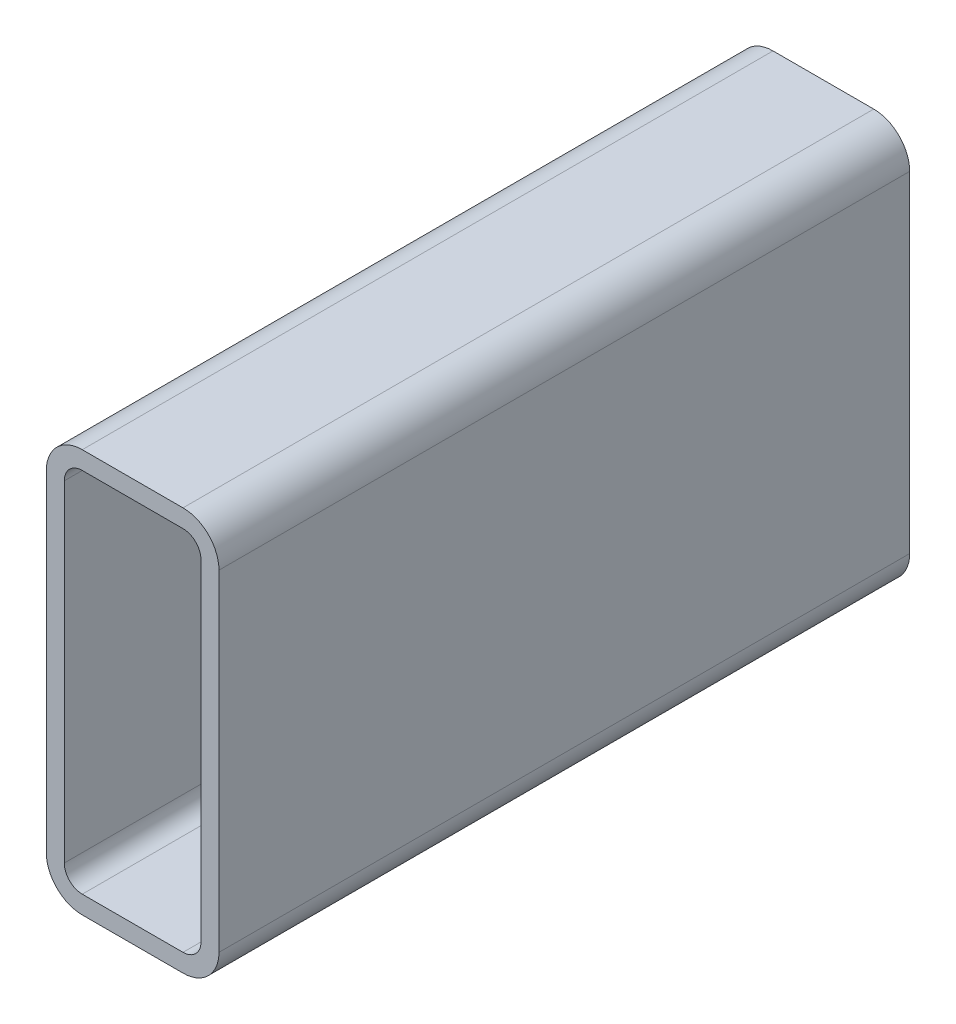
ISO-10303-21;
HEADER;
FILE_DESCRIPTION(('STEP AP214'),'2;1');
FILE_NAME('part.step','',(''),(''),'','','');
FILE_SCHEMA(('AUTOMOTIVE_DESIGN { 1 0 10303 214 1 1 1 1 }'));
ENDSEC;
DATA;
#1=APPLICATION_CONTEXT('core data for automotive mechanical design processes');
#2=APPLICATION_PROTOCOL_DEFINITION('international standard','automotive_design',2000,#1);
#3=PRODUCT_CONTEXT('',#1,'mechanical');
#4=PRODUCT('Part','Part','',(#3));
#5=PRODUCT_RELATED_PRODUCT_CATEGORY('part','',(#4));
#6=PRODUCT_DEFINITION_FORMATION('','',#4);
#7=PRODUCT_DEFINITION_CONTEXT('part definition',#1,'design');
#8=PRODUCT_DEFINITION('design','',#6,#7);
#9=PRODUCT_DEFINITION_SHAPE('','',#8);
#10=(LENGTH_UNIT() NAMED_UNIT(*) SI_UNIT(.MILLI.,.METRE.));
#11=(NAMED_UNIT(*) PLANE_ANGLE_UNIT() SI_UNIT($,.RADIAN.));
#12=(NAMED_UNIT(*) SI_UNIT($,.STERADIAN.) SOLID_ANGLE_UNIT());
#13=UNCERTAINTY_MEASURE_WITH_UNIT(LENGTH_MEASURE(1.E-05),#10,'distance_accuracy_value','');
#14=(GEOMETRIC_REPRESENTATION_CONTEXT(3) GLOBAL_UNCERTAINTY_ASSIGNED_CONTEXT((#13)) GLOBAL_UNIT_ASSIGNED_CONTEXT((#10,
#11,#12)) REPRESENTATION_CONTEXT('',''));
#15=CARTESIAN_POINT('',(0.,0.,0.));
#16=DIRECTION('',(0.,0.,1.));
#17=DIRECTION('',(1.,0.,0.));
#18=AXIS2_PLACEMENT_3D('',#15,#16,#17);
#19=CARTESIAN_POINT('',(18.3641160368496,163.914039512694,304.8));
#20=DIRECTION('',(0.,0.,1.));
#21=DIRECTION('',(1.,0.,0.));
#22=AXIS2_PLACEMENT_3D('',#19,#20,#21);
#23=PLANE('',#22);
#24=CARTESIAN_POINT('',(18.3641160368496,163.914039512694,304.8));
#25=DIRECTION('',(0.,0.,1.));
#26=DIRECTION('',(1.,0.,0.));
#27=AXIS2_PLACEMENT_3D('',#24,#25,#26);
#28=CIRCLE('',#27,15.875);
#29=CARTESIAN_POINT('',(18.3641160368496,179.789039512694,304.8));
#30=VERTEX_POINT('',#29);
#31=CARTESIAN_POINT('',(2.48911603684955,163.914039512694,304.8));
#32=VERTEX_POINT('',#31);
#33=EDGE_CURVE('E211',#30,#32,#28,.T.);
#34=ORIENTED_EDGE('',*,*,#33,.T.);
#35=DIRECTION('',(0.,-1.,0.));
#36=VECTOR('',#35,1.);
#37=CARTESIAN_POINT('',(2.48911603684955,17.8640395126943,304.8));
#38=LINE('',#37,#36);
#39=CARTESIAN_POINT('',(2.48911603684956,17.8640395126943,304.8));
#40=VERTEX_POINT('',#39);
#41=EDGE_CURVE('E214',#32,#40,#38,.T.);
#42=ORIENTED_EDGE('',*,*,#41,.T.);
#43=CARTESIAN_POINT('',(18.3641160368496,17.8640395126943,304.8));
#44=DIRECTION('',(0.,0.,1.));
#45=DIRECTION('',(1.,0.,0.));
#46=AXIS2_PLACEMENT_3D('',#43,#44,#45);
#47=CIRCLE('',#46,15.875);
#48=CARTESIAN_POINT('',(18.3641160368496,1.98903951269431,304.8));
#49=VERTEX_POINT('',#48);
#50=EDGE_CURVE('E217',#40,#49,#47,.T.);
#51=ORIENTED_EDGE('',*,*,#50,.T.);
#52=DIRECTION('',(1.,0.,0.));
#53=VECTOR('',#52,1.);
#54=CARTESIAN_POINT('',(62.8141160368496,1.98903951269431,304.8));
#55=LINE('',#54,#53);
#56=CARTESIAN_POINT('',(62.8141160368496,1.98903951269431,304.8));
#57=VERTEX_POINT('',#56);
#58=EDGE_CURVE('E219',#49,#57,#55,.T.);
#59=ORIENTED_EDGE('',*,*,#58,.T.);
#60=CARTESIAN_POINT('',(62.8141160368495,17.8640395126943,304.8));
#61=DIRECTION('',(0.,0.,1.));
#62=DIRECTION('',(1.,0.,0.));
#63=AXIS2_PLACEMENT_3D('',#60,#61,#62);
#64=CIRCLE('',#63,15.875);
#65=CARTESIAN_POINT('',(78.6891160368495,17.8640395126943,304.8));
#66=VERTEX_POINT('',#65);
#67=EDGE_CURVE('E221',#57,#66,#64,.T.);
#68=ORIENTED_EDGE('',*,*,#67,.T.);
#69=DIRECTION('',(0.,1.,0.));
#70=VECTOR('',#69,1.);
#71=CARTESIAN_POINT('',(78.6891160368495,163.914039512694,304.8));
#72=LINE('',#71,#70);
#73=CARTESIAN_POINT('',(78.6891160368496,163.914039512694,304.8));
#74=VERTEX_POINT('',#73);
#75=EDGE_CURVE('E223',#66,#74,#72,.T.);
#76=ORIENTED_EDGE('',*,*,#75,.T.);
#77=CARTESIAN_POINT('',(62.8141160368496,163.914039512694,304.8));
#78=DIRECTION('',(0.,0.,1.));
#79=DIRECTION('',(1.,0.,0.));
#80=AXIS2_PLACEMENT_3D('',#77,#78,#79);
#81=CIRCLE('',#80,15.875);
#82=CARTESIAN_POINT('',(62.8141160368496,179.789039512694,304.8));
#83=VERTEX_POINT('',#82);
#84=EDGE_CURVE('E225',#74,#83,#81,.T.);
#85=ORIENTED_EDGE('',*,*,#84,.T.);
#86=DIRECTION('',(-1.,0.,0.));
#87=VECTOR('',#86,1.);
#88=CARTESIAN_POINT('',(18.3641160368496,179.789039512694,304.8));
#89=LINE('',#88,#87);
#90=EDGE_CURVE('E227',#83,#30,#89,.T.);
#91=ORIENTED_EDGE('',*,*,#90,.T.);
#92=EDGE_LOOP('',(#34,#42,#51,#59,#68,#76,#85,#91));
#93=FACE_BOUND('',#92,.T.);
#94=DIRECTION('',(0.,-1.,0.));
#95=VECTOR('',#94,1.);
#96=CARTESIAN_POINT('',(10.4266160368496,17.8640395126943,304.8));
#97=LINE('',#96,#95);
#98=CARTESIAN_POINT('',(10.4266160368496,163.914039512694,304.8));
#99=VERTEX_POINT('',#98);
#100=CARTESIAN_POINT('',(10.4266160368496,17.8640395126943,304.8));
#101=VERTEX_POINT('',#100);
#102=EDGE_CURVE('E154',#99,#101,#97,.T.);
#103=ORIENTED_EDGE('',*,*,#102,.F.);
#104=CARTESIAN_POINT('',(18.3641160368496,163.914039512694,304.8));
#105=DIRECTION('',(0.,0.,1.));
#106=DIRECTION('',(1.,0.,0.));
#107=AXIS2_PLACEMENT_3D('',#104,#105,#106);
#108=CIRCLE('',#107,7.93750000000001);
#109=CARTESIAN_POINT('',(18.3641160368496,171.851539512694,304.8));
#110=VERTEX_POINT('',#109);
#111=EDGE_CURVE('E146',#110,#99,#108,.T.);
#112=ORIENTED_EDGE('',*,*,#111,.F.);
#113=DIRECTION('',(-1.,0.,0.));
#114=VECTOR('',#113,1.);
#115=CARTESIAN_POINT('',(18.3641160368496,171.851539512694,304.8));
#116=LINE('',#115,#114);
#117=CARTESIAN_POINT('',(62.8141160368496,171.851539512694,304.8));
#118=VERTEX_POINT('',#117);
#119=EDGE_CURVE('E179',#118,#110,#116,.T.);
#120=ORIENTED_EDGE('',*,*,#119,.F.);
#121=CARTESIAN_POINT('',(62.8141160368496,163.914039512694,304.8));
#122=DIRECTION('',(0.,0.,1.));
#123=DIRECTION('',(1.,0.,0.));
#124=AXIS2_PLACEMENT_3D('',#121,#122,#123);
#125=CIRCLE('',#124,7.93750000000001);
#126=CARTESIAN_POINT('',(70.7516160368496,163.914039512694,304.8));
#127=VERTEX_POINT('',#126);
#128=EDGE_CURVE('E177',#127,#118,#125,.T.);
#129=ORIENTED_EDGE('',*,*,#128,.F.);
#130=DIRECTION('',(0.,1.,0.));
#131=VECTOR('',#130,1.);
#132=CARTESIAN_POINT('',(70.7516160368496,163.914039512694,304.8));
#133=LINE('',#132,#131);
#134=CARTESIAN_POINT('',(70.7516160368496,17.8640395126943,304.8));
#135=VERTEX_POINT('',#134);
#136=EDGE_CURVE('E175',#135,#127,#133,.T.);
#137=ORIENTED_EDGE('',*,*,#136,.F.);
#138=CARTESIAN_POINT('',(62.8141160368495,17.8640395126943,304.8));
#139=DIRECTION('',(0.,0.,1.));
#140=DIRECTION('',(1.,0.,0.));
#141=AXIS2_PLACEMENT_3D('',#138,#139,#140);
#142=CIRCLE('',#141,7.9375);
#143=CARTESIAN_POINT('',(62.8141160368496,9.9265395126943,304.8));
#144=VERTEX_POINT('',#143);
#145=EDGE_CURVE('E173',#144,#135,#142,.T.);
#146=ORIENTED_EDGE('',*,*,#145,.F.);
#147=DIRECTION('',(1.,0.,0.));
#148=VECTOR('',#147,1.);
#149=CARTESIAN_POINT('',(62.8141160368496,9.92653951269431,304.8));
#150=LINE('',#149,#148);
#151=CARTESIAN_POINT('',(18.3641160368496,9.92653951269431,304.8));
#152=VERTEX_POINT('',#151);
#153=EDGE_CURVE('E169',#152,#144,#150,.T.);
#154=ORIENTED_EDGE('',*,*,#153,.F.);
#155=CARTESIAN_POINT('',(18.3641160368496,17.8640395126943,304.8));
#156=DIRECTION('',(0.,0.,1.));
#157=DIRECTION('',(1.,0.,0.));
#158=AXIS2_PLACEMENT_3D('',#155,#156,#157);
#159=CIRCLE('',#158,7.9375);
#160=EDGE_CURVE('E167',#101,#152,#159,.T.);
#161=ORIENTED_EDGE('',*,*,#160,.F.);
#162=EDGE_LOOP('',(#103,#112,#120,#129,#137,#146,#154,#161));
#163=FACE_BOUND('',#162,.T.);
#164=ADVANCED_FACE('F33',(#93,#163),#23,.T.);
#165=CARTESIAN_POINT('',(18.3641160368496,163.914039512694,0.));
#166=DIRECTION('',(0.,0.,1.));
#167=DIRECTION('',(1.,0.,0.));
#168=AXIS2_PLACEMENT_3D('',#165,#166,#167);
#169=PLANE('',#168);
#170=CARTESIAN_POINT('',(18.3641160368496,163.914039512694,0.));
#171=DIRECTION('',(0.,0.,1.));
#172=DIRECTION('',(1.,0.,0.));
#173=AXIS2_PLACEMENT_3D('',#170,#171,#172);
#174=CIRCLE('',#173,15.875);
#175=CARTESIAN_POINT('',(18.3641160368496,179.789039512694,0.));
#176=VERTEX_POINT('',#175);
#177=CARTESIAN_POINT('',(2.48911603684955,163.914039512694,0.));
#178=VERTEX_POINT('',#177);
#179=EDGE_CURVE('E162',#176,#178,#174,.T.);
#180=ORIENTED_EDGE('',*,*,#179,.F.);
#181=DIRECTION('',(-1.,0.,0.));
#182=VECTOR('',#181,1.);
#183=CARTESIAN_POINT('',(18.3641160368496,179.789039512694,0.));
#184=LINE('',#183,#182);
#185=CARTESIAN_POINT('',(62.8141160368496,179.789039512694,0.));
#186=VERTEX_POINT('',#185);
#187=EDGE_CURVE('E215',#186,#176,#184,.T.);
#188=ORIENTED_EDGE('',*,*,#187,.F.);
#189=CARTESIAN_POINT('',(62.8141160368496,163.914039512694,0.));
#190=DIRECTION('',(0.,0.,1.));
#191=DIRECTION('',(1.,0.,0.));
#192=AXIS2_PLACEMENT_3D('',#189,#190,#191);
#193=CIRCLE('',#192,15.875);
#194=CARTESIAN_POINT('',(78.6891160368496,163.914039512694,0.));
#195=VERTEX_POINT('',#194);
#196=EDGE_CURVE('E242',#195,#186,#193,.T.);
#197=ORIENTED_EDGE('',*,*,#196,.F.);
#198=DIRECTION('',(0.,1.,0.));
#199=VECTOR('',#198,1.);
#200=CARTESIAN_POINT('',(78.6891160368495,163.914039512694,0.));
#201=LINE('',#200,#199);
#202=CARTESIAN_POINT('',(78.6891160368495,17.8640395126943,0.));
#203=VERTEX_POINT('',#202);
#204=EDGE_CURVE('E240',#203,#195,#201,.T.);
#205=ORIENTED_EDGE('',*,*,#204,.F.);
#206=CARTESIAN_POINT('',(62.8141160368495,17.8640395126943,0.));
#207=DIRECTION('',(0.,0.,1.));
#208=DIRECTION('',(1.,0.,0.));
#209=AXIS2_PLACEMENT_3D('',#206,#207,#208);
#210=CIRCLE('',#209,15.875);
#211=CARTESIAN_POINT('',(62.8141160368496,1.98903951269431,0.));
#212=VERTEX_POINT('',#211);
#213=EDGE_CURVE('E238',#212,#203,#210,.T.);
#214=ORIENTED_EDGE('',*,*,#213,.F.);
#215=DIRECTION('',(1.,0.,0.));
#216=VECTOR('',#215,1.);
#217=CARTESIAN_POINT('',(62.8141160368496,1.98903951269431,0.));
#218=LINE('',#217,#216);
#219=CARTESIAN_POINT('',(18.3641160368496,1.98903951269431,0.));
#220=VERTEX_POINT('',#219);
#221=EDGE_CURVE('E236',#220,#212,#218,.T.);
#222=ORIENTED_EDGE('',*,*,#221,.F.);
#223=CARTESIAN_POINT('',(18.3641160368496,17.8640395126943,0.));
#224=DIRECTION('',(0.,0.,1.));
#225=DIRECTION('',(1.,0.,0.));
#226=AXIS2_PLACEMENT_3D('',#223,#224,#225);
#227=CIRCLE('',#226,15.875);
#228=CARTESIAN_POINT('',(2.48911603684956,17.8640395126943,0.));
#229=VERTEX_POINT('',#228);
#230=EDGE_CURVE('E234',#229,#220,#227,.T.);
#231=ORIENTED_EDGE('',*,*,#230,.F.);
#232=DIRECTION('',(0.,-1.,0.));
#233=VECTOR('',#232,1.);
#234=CARTESIAN_POINT('',(2.48911603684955,17.8640395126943,0.));
#235=LINE('',#234,#233);
#236=EDGE_CURVE('E232',#178,#229,#235,.T.);
#237=ORIENTED_EDGE('',*,*,#236,.F.);
#238=EDGE_LOOP('',(#180,#188,#197,#205,#214,#222,#231,#237));
#239=FACE_BOUND('',#238,.T.);
#240=CARTESIAN_POINT('',(18.3641160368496,163.914039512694,0.));
#241=DIRECTION('',(0.,0.,1.));
#242=DIRECTION('',(1.,0.,0.));
#243=AXIS2_PLACEMENT_3D('',#240,#241,#242);
#244=CIRCLE('',#243,7.93750000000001);
#245=CARTESIAN_POINT('',(18.3641160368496,171.851539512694,0.));
#246=VERTEX_POINT('',#245);
#247=CARTESIAN_POINT('',(10.4266160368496,163.914039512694,0.));
#248=VERTEX_POINT('',#247);
#249=EDGE_CURVE('E56',#246,#248,#244,.T.);
#250=ORIENTED_EDGE('',*,*,#249,.T.);
#251=DIRECTION('',(0.,-1.,0.));
#252=VECTOR('',#251,1.);
#253=CARTESIAN_POINT('',(10.4266160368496,17.8640395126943,0.));
#254=LINE('',#253,#252);
#255=CARTESIAN_POINT('',(10.4266160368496,17.8640395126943,0.));
#256=VERTEX_POINT('',#255);
#257=EDGE_CURVE('E161',#248,#256,#254,.T.);
#258=ORIENTED_EDGE('',*,*,#257,.T.);
#259=CARTESIAN_POINT('',(18.3641160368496,17.8640395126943,0.));
#260=DIRECTION('',(0.,0.,1.));
#261=DIRECTION('',(1.,0.,0.));
#262=AXIS2_PLACEMENT_3D('',#259,#260,#261);
#263=CIRCLE('',#262,7.9375);
#264=CARTESIAN_POINT('',(18.3641160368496,9.92653951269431,0.));
#265=VERTEX_POINT('',#264);
#266=EDGE_CURVE('E183',#256,#265,#263,.T.);
#267=ORIENTED_EDGE('',*,*,#266,.T.);
#268=DIRECTION('',(1.,0.,0.));
#269=VECTOR('',#268,1.);
#270=CARTESIAN_POINT('',(62.8141160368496,9.92653951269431,0.));
#271=LINE('',#270,#269);
#272=CARTESIAN_POINT('',(62.8141160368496,9.9265395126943,0.));
#273=VERTEX_POINT('',#272);
#274=EDGE_CURVE('E186',#265,#273,#271,.T.);
#275=ORIENTED_EDGE('',*,*,#274,.T.);
#276=CARTESIAN_POINT('',(62.8141160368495,17.8640395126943,0.));
#277=DIRECTION('',(0.,0.,1.));
#278=DIRECTION('',(1.,0.,0.));
#279=AXIS2_PLACEMENT_3D('',#276,#277,#278);
#280=CIRCLE('',#279,7.9375);
#281=CARTESIAN_POINT('',(70.7516160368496,17.8640395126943,0.));
#282=VERTEX_POINT('',#281);
#283=EDGE_CURVE('E189',#273,#282,#280,.T.);
#284=ORIENTED_EDGE('',*,*,#283,.T.);
#285=DIRECTION('',(0.,1.,0.));
#286=VECTOR('',#285,1.);
#287=CARTESIAN_POINT('',(70.7516160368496,163.914039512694,0.));
#288=LINE('',#287,#286);
#289=CARTESIAN_POINT('',(70.7516160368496,163.914039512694,0.));
#290=VERTEX_POINT('',#289);
#291=EDGE_CURVE('E192',#282,#290,#288,.T.);
#292=ORIENTED_EDGE('',*,*,#291,.T.);
#293=CARTESIAN_POINT('',(62.8141160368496,163.914039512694,0.));
#294=DIRECTION('',(0.,0.,1.));
#295=DIRECTION('',(1.,0.,0.));
#296=AXIS2_PLACEMENT_3D('',#293,#294,#295);
#297=CIRCLE('',#296,7.93750000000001);
#298=CARTESIAN_POINT('',(62.8141160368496,171.851539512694,0.));
#299=VERTEX_POINT('',#298);
#300=EDGE_CURVE('E195',#290,#299,#297,.T.);
#301=ORIENTED_EDGE('',*,*,#300,.T.);
#302=DIRECTION('',(-1.,0.,0.));
#303=VECTOR('',#302,1.);
#304=CARTESIAN_POINT('',(18.3641160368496,171.851539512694,0.));
#305=LINE('',#304,#303);
#306=EDGE_CURVE('E155',#299,#246,#305,.T.);
#307=ORIENTED_EDGE('',*,*,#306,.T.);
#308=EDGE_LOOP('',(#250,#258,#267,#275,#284,#292,#301,#307));
#309=FACE_BOUND('',#308,.T.);
#310=ADVANCED_FACE('F272',(#239,#309),#169,.F.);
#311=CARTESIAN_POINT('',(18.3641160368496,163.914039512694,304.8));
#312=DIRECTION('',(0.,0.,-1.));
#313=DIRECTION('',(-1.,0.,0.));
#314=AXIS2_PLACEMENT_3D('',#311,#312,#313);
#315=CYLINDRICAL_SURFACE('',#314,15.875);
#316=ORIENTED_EDGE('',*,*,#179,.T.);
#317=DIRECTION('',(0.,0.,-1.));
#318=VECTOR('',#317,1.);
#319=CARTESIAN_POINT('',(2.48911603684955,163.914039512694,304.8));
#320=LINE('',#319,#318);
#321=EDGE_CURVE('E11',#32,#178,#320,.T.);
#322=ORIENTED_EDGE('',*,*,#321,.F.);
#323=ORIENTED_EDGE('',*,*,#33,.F.);
#324=DIRECTION('',(0.,0.,-1.));
#325=VECTOR('',#324,1.);
#326=CARTESIAN_POINT('',(18.3641160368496,179.789039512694,304.8));
#327=LINE('',#326,#325);
#328=EDGE_CURVE('E229',#30,#176,#327,.T.);
#329=ORIENTED_EDGE('',*,*,#328,.T.);
#330=EDGE_LOOP('',(#316,#322,#323,#329));
#331=FACE_BOUND('',#330,.T.);
#332=ADVANCED_FACE('F35',(#331),#315,.T.);
#333=CARTESIAN_POINT('',(2.48911603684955,17.8640395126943,304.8));
#334=DIRECTION('',(1.,0.,0.));
#335=DIRECTION('',(0.,0.,-1.));
#336=AXIS2_PLACEMENT_3D('',#333,#334,#335);
#337=PLANE('',#336);
#338=ORIENTED_EDGE('',*,*,#236,.T.);
#339=DIRECTION('',(0.,0.,-1.));
#340=VECTOR('',#339,1.);
#341=CARTESIAN_POINT('',(2.48911603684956,17.8640395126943,304.8));
#342=LINE('',#341,#340);
#343=EDGE_CURVE('E41',#40,#229,#342,.T.);
#344=ORIENTED_EDGE('',*,*,#343,.F.);
#345=ORIENTED_EDGE('',*,*,#41,.F.);
#346=ORIENTED_EDGE('',*,*,#321,.T.);
#347=EDGE_LOOP('',(#338,#344,#345,#346));
#348=FACE_BOUND('',#347,.T.);
#349=ADVANCED_FACE('F289',(#348),#337,.F.);
#350=CARTESIAN_POINT('',(18.3641160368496,17.8640395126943,304.8));
#351=DIRECTION('',(0.,0.,-1.));
#352=DIRECTION('',(-1.,0.,0.));
#353=AXIS2_PLACEMENT_3D('',#350,#351,#352);
#354=CYLINDRICAL_SURFACE('',#353,15.875);
#355=ORIENTED_EDGE('',*,*,#230,.T.);
#356=DIRECTION('',(0.,0.,-1.));
#357=VECTOR('',#356,1.);
#358=CARTESIAN_POINT('',(18.3641160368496,1.98903951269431,304.8));
#359=LINE('',#358,#357);
#360=EDGE_CURVE('E259',#49,#220,#359,.T.);
#361=ORIENTED_EDGE('',*,*,#360,.F.);
#362=ORIENTED_EDGE('',*,*,#50,.F.);
#363=ORIENTED_EDGE('',*,*,#343,.T.);
#364=EDGE_LOOP('',(#355,#361,#362,#363));
#365=FACE_BOUND('',#364,.T.);
#366=ADVANCED_FACE('F266',(#365),#354,.T.);
#367=CARTESIAN_POINT('',(62.8141160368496,1.98903951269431,304.8));
#368=DIRECTION('',(0.,1.,0.));
#369=DIRECTION('',(0.,0.,1.));
#370=AXIS2_PLACEMENT_3D('',#367,#368,#369);
#371=PLANE('',#370);
#372=ORIENTED_EDGE('',*,*,#221,.T.);
#373=DIRECTION('',(0.,0.,-1.));
#374=VECTOR('',#373,1.);
#375=CARTESIAN_POINT('',(62.8141160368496,1.98903951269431,304.8));
#376=LINE('',#375,#374);
#377=EDGE_CURVE('E256',#57,#212,#376,.T.);
#378=ORIENTED_EDGE('',*,*,#377,.F.);
#379=ORIENTED_EDGE('',*,*,#58,.F.);
#380=ORIENTED_EDGE('',*,*,#360,.T.);
#381=EDGE_LOOP('',(#372,#378,#379,#380));
#382=FACE_BOUND('',#381,.T.);
#383=ADVANCED_FACE('F278',(#382),#371,.F.);
#384=CARTESIAN_POINT('',(62.8141160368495,17.8640395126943,304.8));
#385=DIRECTION('',(0.,0.,-1.));
#386=DIRECTION('',(-1.,0.,0.));
#387=AXIS2_PLACEMENT_3D('',#384,#385,#386);
#388=CYLINDRICAL_SURFACE('',#387,15.875);
#389=ORIENTED_EDGE('',*,*,#213,.T.);
#390=DIRECTION('',(0.,0.,-1.));
#391=VECTOR('',#390,1.);
#392=CARTESIAN_POINT('',(78.6891160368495,17.8640395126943,304.8));
#393=LINE('',#392,#391);
#394=EDGE_CURVE('E253',#66,#203,#393,.T.);
#395=ORIENTED_EDGE('',*,*,#394,.F.);
#396=ORIENTED_EDGE('',*,*,#67,.F.);
#397=ORIENTED_EDGE('',*,*,#377,.T.);
#398=EDGE_LOOP('',(#389,#395,#396,#397));
#399=FACE_BOUND('',#398,.T.);
#400=ADVANCED_FACE('F282',(#399),#388,.T.);
#401=CARTESIAN_POINT('',(78.6891160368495,163.914039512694,304.8));
#402=DIRECTION('',(-1.,0.,0.));
#403=DIRECTION('',(0.,0.,1.));
#404=AXIS2_PLACEMENT_3D('',#401,#402,#403);
#405=PLANE('',#404);
#406=ORIENTED_EDGE('',*,*,#204,.T.);
#407=DIRECTION('',(0.,0.,-1.));
#408=VECTOR('',#407,1.);
#409=CARTESIAN_POINT('',(78.6891160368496,163.914039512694,304.8));
#410=LINE('',#409,#408);
#411=EDGE_CURVE('E250',#74,#195,#410,.T.);
#412=ORIENTED_EDGE('',*,*,#411,.F.);
#413=ORIENTED_EDGE('',*,*,#75,.F.);
#414=ORIENTED_EDGE('',*,*,#394,.T.);
#415=EDGE_LOOP('',(#406,#412,#413,#414));
#416=FACE_BOUND('',#415,.T.);
#417=ADVANCED_FACE('F302',(#416),#405,.F.);
#418=CARTESIAN_POINT('',(62.8141160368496,163.914039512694,304.8));
#419=DIRECTION('',(0.,0.,-1.));
#420=DIRECTION('',(-1.,0.,0.));
#421=AXIS2_PLACEMENT_3D('',#418,#419,#420);
#422=CYLINDRICAL_SURFACE('',#421,15.875);
#423=ORIENTED_EDGE('',*,*,#196,.T.);
#424=DIRECTION('',(0.,0.,-1.));
#425=VECTOR('',#424,1.);
#426=CARTESIAN_POINT('',(62.8141160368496,179.789039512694,304.8));
#427=LINE('',#426,#425);
#428=EDGE_CURVE('E247',#83,#186,#427,.T.);
#429=ORIENTED_EDGE('',*,*,#428,.F.);
#430=ORIENTED_EDGE('',*,*,#84,.F.);
#431=ORIENTED_EDGE('',*,*,#411,.T.);
#432=EDGE_LOOP('',(#423,#429,#430,#431));
#433=FACE_BOUND('',#432,.T.);
#434=ADVANCED_FACE('F300',(#433),#422,.T.);
#435=CARTESIAN_POINT('',(18.3641160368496,179.789039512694,304.8));
#436=DIRECTION('',(0.,-1.,0.));
#437=DIRECTION('',(0.,0.,-1.));
#438=AXIS2_PLACEMENT_3D('',#435,#436,#437);
#439=PLANE('',#438);
#440=ORIENTED_EDGE('',*,*,#187,.T.);
#441=ORIENTED_EDGE('',*,*,#328,.F.);
#442=ORIENTED_EDGE('',*,*,#90,.F.);
#443=ORIENTED_EDGE('',*,*,#428,.T.);
#444=EDGE_LOOP('',(#440,#441,#442,#443));
#445=FACE_BOUND('',#444,.T.);
#446=ADVANCED_FACE('F295',(#445),#439,.F.);
#447=CARTESIAN_POINT('',(18.3641160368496,163.914039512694,304.8));
#448=DIRECTION('',(0.,0.,-1.));
#449=DIRECTION('',(-1.,0.,0.));
#450=AXIS2_PLACEMENT_3D('',#447,#448,#449);
#451=CYLINDRICAL_SURFACE('',#450,7.93750000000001);
#452=ORIENTED_EDGE('',*,*,#249,.F.);
#453=DIRECTION('',(0.,0.,-1.));
#454=VECTOR('',#453,1.);
#455=CARTESIAN_POINT('',(18.3641160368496,171.851539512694,304.8));
#456=LINE('',#455,#454);
#457=EDGE_CURVE('E150',#110,#246,#456,.T.);
#458=ORIENTED_EDGE('',*,*,#457,.F.);
#459=ORIENTED_EDGE('',*,*,#111,.T.);
#460=DIRECTION('',(0.,0.,-1.));
#461=VECTOR('',#460,1.);
#462=CARTESIAN_POINT('',(10.4266160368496,163.914039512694,304.8));
#463=LINE('',#462,#461);
#464=EDGE_CURVE('E149',#99,#248,#463,.T.);
#465=ORIENTED_EDGE('',*,*,#464,.T.);
#466=EDGE_LOOP('',(#452,#458,#459,#465));
#467=FACE_BOUND('',#466,.T.);
#468=ADVANCED_FACE('F148',(#467),#451,.F.);
#469=CARTESIAN_POINT('',(10.4266160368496,17.8640395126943,304.8));
#470=DIRECTION('',(1.,0.,0.));
#471=DIRECTION('',(0.,0.,-1.));
#472=AXIS2_PLACEMENT_3D('',#469,#470,#471);
#473=PLANE('',#472);
#474=ORIENTED_EDGE('',*,*,#257,.F.);
#475=ORIENTED_EDGE('',*,*,#464,.F.);
#476=ORIENTED_EDGE('',*,*,#102,.T.);
#477=DIRECTION('',(0.,0.,-1.));
#478=VECTOR('',#477,1.);
#479=CARTESIAN_POINT('',(10.4266160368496,17.8640395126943,304.8));
#480=LINE('',#479,#478);
#481=EDGE_CURVE('E163',#101,#256,#480,.T.);
#482=ORIENTED_EDGE('',*,*,#481,.T.);
#483=EDGE_LOOP('',(#474,#475,#476,#482));
#484=FACE_BOUND('',#483,.T.);
#485=ADVANCED_FACE('F158',(#484),#473,.T.);
#486=CARTESIAN_POINT('',(18.3641160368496,17.8640395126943,304.8));
#487=DIRECTION('',(0.,0.,-1.));
#488=DIRECTION('',(-1.,0.,0.));
#489=AXIS2_PLACEMENT_3D('',#486,#487,#488);
#490=CYLINDRICAL_SURFACE('',#489,7.9375);
#491=ORIENTED_EDGE('',*,*,#266,.F.);
#492=ORIENTED_EDGE('',*,*,#481,.F.);
#493=ORIENTED_EDGE('',*,*,#160,.T.);
#494=DIRECTION('',(0.,0.,-1.));
#495=VECTOR('',#494,1.);
#496=CARTESIAN_POINT('',(18.3641160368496,9.92653951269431,304.8));
#497=LINE('',#496,#495);
#498=EDGE_CURVE('E208',#152,#265,#497,.T.);
#499=ORIENTED_EDGE('',*,*,#498,.T.);
#500=EDGE_LOOP('',(#491,#492,#493,#499));
#501=FACE_BOUND('',#500,.T.);
#502=ADVANCED_FACE('F327',(#501),#490,.F.);
#503=CARTESIAN_POINT('',(62.8141160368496,9.92653951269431,304.8));
#504=DIRECTION('',(0.,1.,0.));
#505=DIRECTION('',(0.,0.,1.));
#506=AXIS2_PLACEMENT_3D('',#503,#504,#505);
#507=PLANE('',#506);
#508=ORIENTED_EDGE('',*,*,#274,.F.);
#509=ORIENTED_EDGE('',*,*,#498,.F.);
#510=ORIENTED_EDGE('',*,*,#153,.T.);
#511=DIRECTION('',(0.,0.,-1.));
#512=VECTOR('',#511,1.);
#513=CARTESIAN_POINT('',(62.8141160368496,9.9265395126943,304.8));
#514=LINE('',#513,#512);
#515=EDGE_CURVE('E206',#144,#273,#514,.T.);
#516=ORIENTED_EDGE('',*,*,#515,.T.);
#517=EDGE_LOOP('',(#508,#509,#510,#516));
#518=FACE_BOUND('',#517,.T.);
#519=ADVANCED_FACE('F331',(#518),#507,.T.);
#520=CARTESIAN_POINT('',(62.8141160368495,17.8640395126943,304.8));
#521=DIRECTION('',(0.,0.,-1.));
#522=DIRECTION('',(-1.,0.,0.));
#523=AXIS2_PLACEMENT_3D('',#520,#521,#522);
#524=CYLINDRICAL_SURFACE('',#523,7.9375);
#525=ORIENTED_EDGE('',*,*,#283,.F.);
#526=ORIENTED_EDGE('',*,*,#515,.F.);
#527=ORIENTED_EDGE('',*,*,#145,.T.);
#528=DIRECTION('',(0.,0.,-1.));
#529=VECTOR('',#528,1.);
#530=CARTESIAN_POINT('',(70.7516160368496,17.8640395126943,304.8));
#531=LINE('',#530,#529);
#532=EDGE_CURVE('E204',#135,#282,#531,.T.);
#533=ORIENTED_EDGE('',*,*,#532,.T.);
#534=EDGE_LOOP('',(#525,#526,#527,#533));
#535=FACE_BOUND('',#534,.T.);
#536=ADVANCED_FACE('F337',(#535),#524,.F.);
#537=CARTESIAN_POINT('',(70.7516160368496,163.914039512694,304.8));
#538=DIRECTION('',(-1.,0.,0.));
#539=DIRECTION('',(0.,0.,1.));
#540=AXIS2_PLACEMENT_3D('',#537,#538,#539);
#541=PLANE('',#540);
#542=ORIENTED_EDGE('',*,*,#291,.F.);
#543=ORIENTED_EDGE('',*,*,#532,.F.);
#544=ORIENTED_EDGE('',*,*,#136,.T.);
#545=DIRECTION('',(0.,0.,-1.));
#546=VECTOR('',#545,1.);
#547=CARTESIAN_POINT('',(70.7516160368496,163.914039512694,304.8));
#548=LINE('',#547,#546);
#549=EDGE_CURVE('E202',#127,#290,#548,.T.);
#550=ORIENTED_EDGE('',*,*,#549,.T.);
#551=EDGE_LOOP('',(#542,#543,#544,#550));
#552=FACE_BOUND('',#551,.T.);
#553=ADVANCED_FACE('F341',(#552),#541,.T.);
#554=CARTESIAN_POINT('',(62.8141160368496,163.914039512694,304.8));
#555=DIRECTION('',(0.,0.,-1.));
#556=DIRECTION('',(-1.,0.,0.));
#557=AXIS2_PLACEMENT_3D('',#554,#555,#556);
#558=CYLINDRICAL_SURFACE('',#557,7.93750000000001);
#559=ORIENTED_EDGE('',*,*,#300,.F.);
#560=ORIENTED_EDGE('',*,*,#549,.F.);
#561=ORIENTED_EDGE('',*,*,#128,.T.);
#562=DIRECTION('',(0.,0.,-1.));
#563=VECTOR('',#562,1.);
#564=CARTESIAN_POINT('',(62.8141160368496,171.851539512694,304.8));
#565=LINE('',#564,#563);
#566=EDGE_CURVE('E48',#118,#299,#565,.T.);
#567=ORIENTED_EDGE('',*,*,#566,.T.);
#568=EDGE_LOOP('',(#559,#560,#561,#567));
#569=FACE_BOUND('',#568,.T.);
#570=ADVANCED_FACE('F345',(#569),#558,.F.);
#571=CARTESIAN_POINT('',(18.3641160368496,171.851539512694,304.8));
#572=DIRECTION('',(0.,-1.,0.));
#573=DIRECTION('',(0.,0.,-1.));
#574=AXIS2_PLACEMENT_3D('',#571,#572,#573);
#575=PLANE('',#574);
#576=ORIENTED_EDGE('',*,*,#306,.F.);
#577=ORIENTED_EDGE('',*,*,#566,.F.);
#578=ORIENTED_EDGE('',*,*,#119,.T.);
#579=ORIENTED_EDGE('',*,*,#457,.T.);
#580=EDGE_LOOP('',(#576,#577,#578,#579));
#581=FACE_BOUND('',#580,.T.);
#582=ADVANCED_FACE('F349',(#581),#575,.T.);
#583=CLOSED_SHELL('',(#164,#310,#332,#349,#366,#383,#400,#417,#434,#446,#468,#485,#502,#519,
#536,#553,#570,#582));
#584=MANIFOLD_SOLID_BREP('B2',#583);
#585=ADVANCED_BREP_SHAPE_REPRESENTATION('',(#18,#584),#14);
#586=SHAPE_DEFINITION_REPRESENTATION(#9,#585);
ENDSEC;
END-ISO-10303-21;
